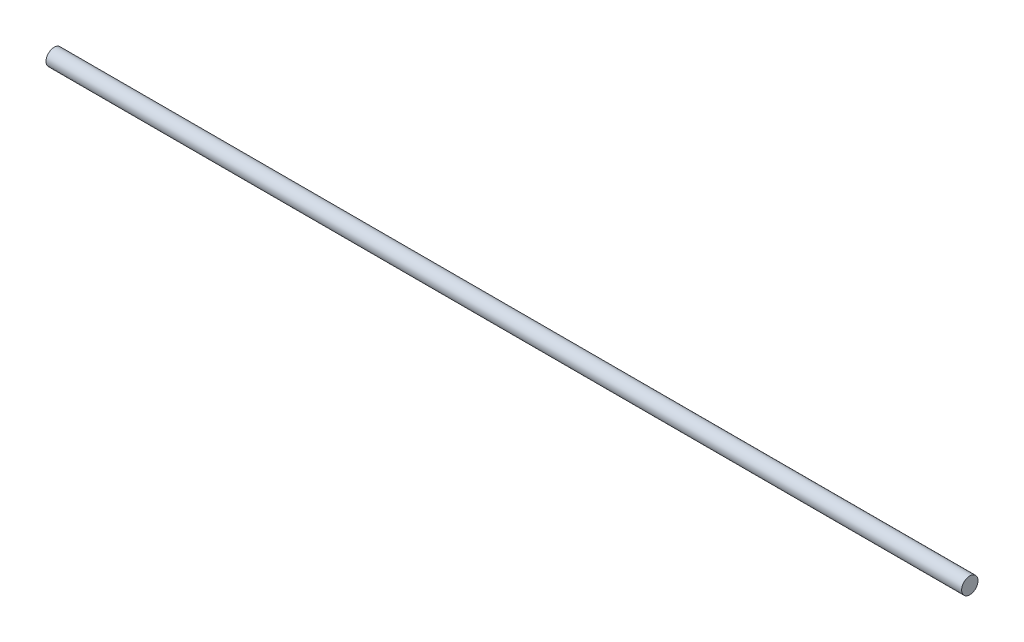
ISO-10303-21;
HEADER;
FILE_DESCRIPTION(('STEP AP214'),'2;1');
FILE_NAME('part.step','',(''),(''),'','','');
FILE_SCHEMA(('AUTOMOTIVE_DESIGN { 1 0 10303 214 1 1 1 1 }'));
ENDSEC;
DATA;
#1=APPLICATION_CONTEXT('core data for automotive mechanical design processes');
#2=APPLICATION_PROTOCOL_DEFINITION('international standard','automotive_design',2000,#1);
#3=PRODUCT_CONTEXT('',#1,'mechanical');
#4=PRODUCT('Part','Part','',(#3));
#5=PRODUCT_RELATED_PRODUCT_CATEGORY('part','',(#4));
#6=PRODUCT_DEFINITION_FORMATION('','',#4);
#7=PRODUCT_DEFINITION_CONTEXT('part definition',#1,'design');
#8=PRODUCT_DEFINITION('design','',#6,#7);
#9=PRODUCT_DEFINITION_SHAPE('','',#8);
#10=(LENGTH_UNIT() NAMED_UNIT(*) SI_UNIT(.MILLI.,.METRE.));
#11=(NAMED_UNIT(*) PLANE_ANGLE_UNIT() SI_UNIT($,.RADIAN.));
#12=(NAMED_UNIT(*) SI_UNIT($,.STERADIAN.) SOLID_ANGLE_UNIT());
#13=UNCERTAINTY_MEASURE_WITH_UNIT(LENGTH_MEASURE(1.E-05),#10,'distance_accuracy_value','');
#14=(GEOMETRIC_REPRESENTATION_CONTEXT(3) GLOBAL_UNCERTAINTY_ASSIGNED_CONTEXT((#13)) GLOBAL_UNIT_ASSIGNED_CONTEXT((#10,
#11,#12)) REPRESENTATION_CONTEXT('',''));
#15=CARTESIAN_POINT('',(0.,0.,0.));
#16=DIRECTION('',(0.,0.,1.));
#17=DIRECTION('',(1.,0.,0.));
#18=AXIS2_PLACEMENT_3D('',#15,#16,#17);
#19=CARTESIAN_POINT('',(139.3,0.,0.));
#20=DIRECTION('',(-1.,0.,0.));
#21=DIRECTION('',(0.,-1.,0.));
#22=AXIS2_PLACEMENT_3D('',#19,#20,#21);
#23=CYLINDRICAL_SURFACE('',#22,2.4875);
#24=CARTESIAN_POINT('',(139.3,0.,0.));
#25=DIRECTION('',(-1.,0.,0.));
#26=DIRECTION('',(0.,-1.,0.));
#27=AXIS2_PLACEMENT_3D('',#24,#25,#26);
#28=CIRCLE('',#27,2.4875);
#29=CARTESIAN_POINT('',(139.3,-2.48750000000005,0.));
#30=VERTEX_POINT('',#29);
#31=EDGE_CURVE('E10',#30,#30,#28,.T.);
#32=ORIENTED_EDGE('',*,*,#31,.T.);
#33=EDGE_LOOP('',(#32));
#34=FACE_BOUND('',#33,.T.);
#35=CARTESIAN_POINT('',(-139.3,0.,0.));
#36=DIRECTION('',(-1.,0.,0.));
#37=DIRECTION('',(0.,-1.,0.));
#38=AXIS2_PLACEMENT_3D('',#35,#36,#37);
#39=CIRCLE('',#38,2.4875);
#40=CARTESIAN_POINT('',(-139.3,-2.4875,0.));
#41=VERTEX_POINT('',#40);
#42=EDGE_CURVE('E21',#41,#41,#39,.T.);
#43=ORIENTED_EDGE('',*,*,#42,.F.);
#44=EDGE_LOOP('',(#43));
#45=FACE_BOUND('',#44,.T.);
#46=ADVANCED_FACE('F14',(#34,#45),#23,.T.);
#47=CARTESIAN_POINT('',(139.3,0.,0.));
#48=DIRECTION('',(-1.,0.,0.));
#49=DIRECTION('',(0.,-1.,0.));
#50=AXIS2_PLACEMENT_3D('',#47,#48,#49);
#51=PLANE('',#50);
#52=ORIENTED_EDGE('',*,*,#31,.F.);
#53=EDGE_LOOP('',(#52));
#54=FACE_BOUND('',#53,.T.);
#55=ADVANCED_FACE('F49',(#54),#51,.F.);
#56=CARTESIAN_POINT('',(-139.3,0.,0.));
#57=DIRECTION('',(-1.,0.,0.));
#58=DIRECTION('',(0.,-1.,0.));
#59=AXIS2_PLACEMENT_3D('',#56,#57,#58);
#60=PLANE('',#59);
#61=ORIENTED_EDGE('',*,*,#42,.T.);
#62=EDGE_LOOP('',(#61));
#63=FACE_BOUND('',#62,.T.);
#64=ADVANCED_FACE('F46',(#63),#60,.T.);
#65=CLOSED_SHELL('',(#46,#55,#64));
#66=MANIFOLD_SOLID_BREP('B1',#65);
#67=ADVANCED_BREP_SHAPE_REPRESENTATION('',(#18,#66),#14);
#68=SHAPE_DEFINITION_REPRESENTATION(#9,#67);
ENDSEC;
END-ISO-10303-21;
